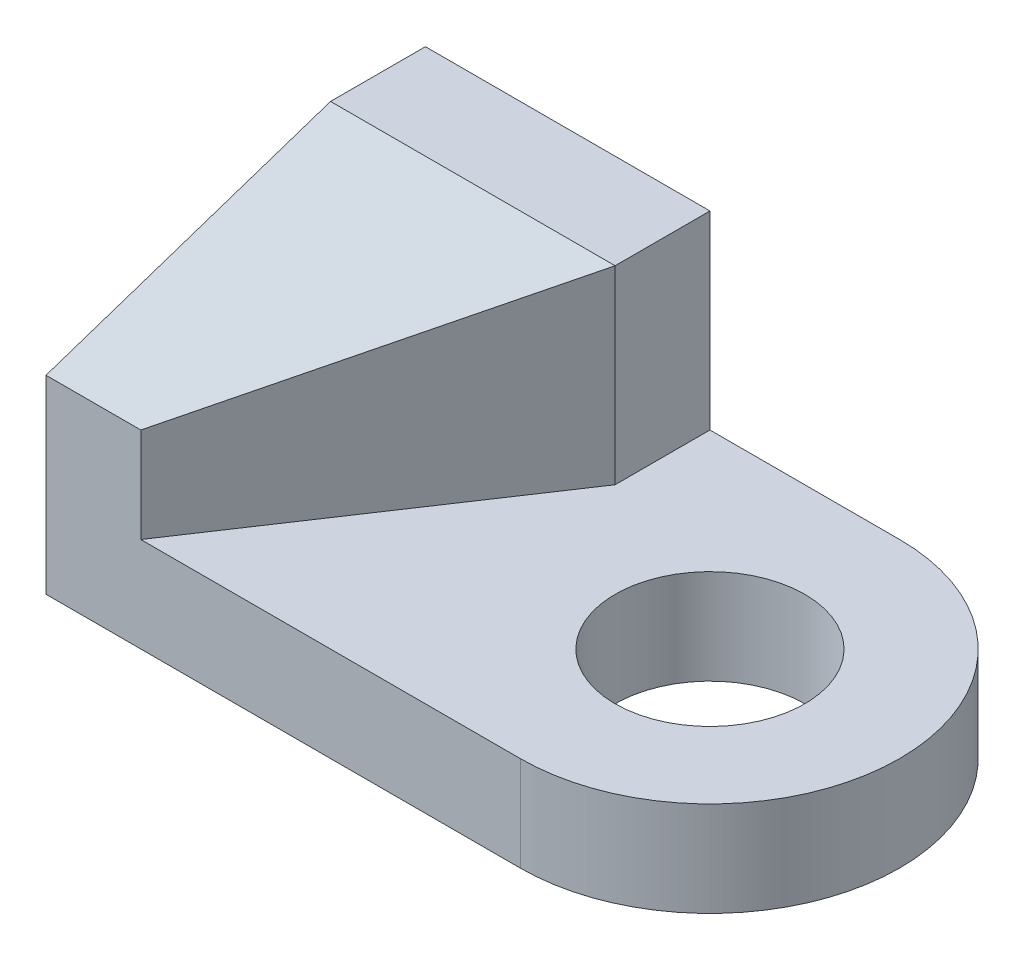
from build123d import *

# Parameters (mm, degrees)
EXTRUDE1_DEPTH = 10
SKETCH2_R      = 10
EXTRUDE2_DEPTH = 10
SKETCH3_W      = 30
SKETCH3_H      = 20
EXTRUDE3_DEPTH = 40
CHAMFER1_SIZE  = 20
CHAMFER1_SIZE2 = 30
CHAMFER2_SIZE  = 10
CHAMFER2_SIZE2 = 30


with BuildPart() as part:
    # Sketch1 → Extrude1 (new body)
    with BuildSketch(Plane(origin=(0, 0, 0), x_dir=(1, 0, 0), z_dir=(0, 1, 0))):
        with BuildLine():
            Line((0, 20), (-50, 20))
            Line((-50, 20), (-50, -20))
            Line((-50, -20), (0, -20))
            ThreePointArc((0, -20), (20, 0), (0, 20))
        make_face()
    extrude(amount=EXTRUDE1_DEPTH)

    # Sketch2 → Extrude2 (cut)
    with BuildSketch(Plane(origin=(0, 10, 0), x_dir=(1, 0, 0), z_dir=(0, 1, 0))):
        with Locations(Location((0, 0, 0), (0, 0, 270))):
            Circle(SKETCH2_R)
    extrude(amount=-EXTRUDE2_DEPTH, mode=Mode.SUBTRACT)

    # Sketch3 → Extrude3 (add, through all)
    with BuildSketch(Plane(origin=(0, 0, -20), x_dir=(-1, 0, 0), z_dir=(0, 0, -1))):
        with Locations((35, 20)):
            Rectangle(SKETCH3_W, SKETCH3_H)
    extrude(amount=-EXTRUDE3_DEPTH)

    # Chamfer1
    chamfer1_edges = [part.edges().sort_by_distance(p)[0] for p in [
        (-20, 20, 20),
    ]]
    chamfer1_side = [part.faces().sort_by_distance(p)[0] for p in [
        (-30.454545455, 13.181818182, 20),
    ]]
    chamfer(chamfer1_edges, length=CHAMFER1_SIZE, length2=CHAMFER1_SIZE2, reference=chamfer1_side[0])

    # Chamfer2
    chamfer2_edges = [part.edges().sort_by_distance(p)[0] for p in [
        (-45, 30, 20),
    ]]
    chamfer2_side = [part.faces().sort_by_distance(p)[0] for p in [
        (-30.714285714, 9.285714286, 20),
    ]]
    chamfer(chamfer2_edges, length=CHAMFER2_SIZE, length2=CHAMFER2_SIZE2, reference=chamfer2_side[0])


solid = part.part
